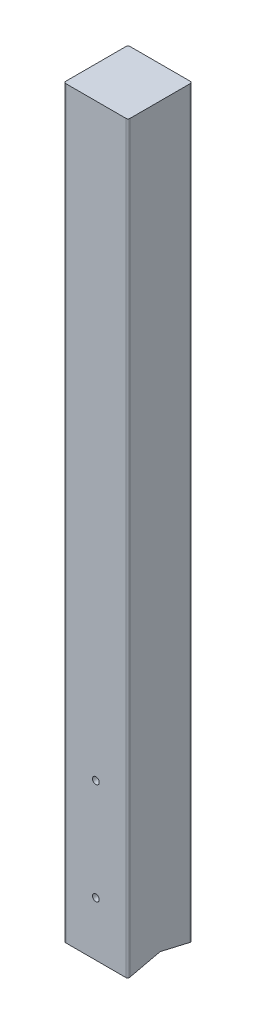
from build123d import *

# Parameters (mm, degrees)
SKETCH3_W                      = 95
SKETCH3_H                      = 95
EXTRUDE_L_NGD_DEPTH            = 1100
CUT_SKRUVH_L_REACH             = 1104.049
SKETCH5_R                      = 5
CUT_SKRUVH_L_DIRECTION_2_REACH = 1104.049
CUT_LUTANDE_BOTTEN_DEPTH       = 1103.049227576
CUT_LUTANDE_BOTTEN_DEPTH_BACK  = 1103.049227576
SKETCH7_R                      = 32.5
CUT_URTAG_R_RFOT_DEPTH         = 290
FILLET_KANTER_R                = 3


with BuildPart() as part:
    # Sketch3 → Extrude l_ngd (new body)
    with BuildSketch(Plane(origin=(0, 0, 0), x_dir=(1, 0, 0), z_dir=(0, 1, 0))):
        Rectangle(SKETCH3_W, SKETCH3_H)
    extrude(amount=EXTRUDE_L_NGD_DEPTH)

    # Sketch5 → Cut skruvh_l (cut, up to next)
    with BuildSketch(Plane.XY, mode=Mode.PRIVATE) as cut_skruvh_l_sk1:
        with Locations(Location((0, 80, 0), (0, 0, 180))):
            Circle(SKETCH5_R)
    cut_skruvh_l_tool1 = extrude(cut_skruvh_l_sk1.sketch, amount=-CUT_SKRUVH_L_REACH, mode=Mode.PRIVATE) & part.part
    # Sketch5 → Cut skruvh_l (cut, up to next)
    with BuildSketch(Plane.XY, mode=Mode.PRIVATE) as cut_skruvh_l_sk2:
        with Locations(Location((0, 230, 0), (0, 0, 180))):
            Circle(SKETCH5_R)
    cut_skruvh_l_tool2 = extrude(cut_skruvh_l_sk2.sketch, amount=-CUT_SKRUVH_L_REACH, mode=Mode.PRIVATE) & part.part
    add(cut_skruvh_l_tool1.solids().sort_by_distance((0, 80, 0))[0], mode=Mode.SUBTRACT)
    add(cut_skruvh_l_tool2.solids().sort_by_distance((0, 230, 0))[0], mode=Mode.SUBTRACT)

    # Sketch5 → Cut skruvh_l direction 2 (cut, up to next)
    with BuildSketch(Plane.XY, mode=Mode.PRIVATE) as cut_skruvh_l_direction_2_sk1:
        with Locations(Location((0, 80, 0), (0, 0, 180))):
            Circle(SKETCH5_R)
    cut_skruvh_l_direction_2_tool1 = extrude(cut_skruvh_l_direction_2_sk1.sketch, amount=CUT_SKRUVH_L_DIRECTION_2_REACH, mode=Mode.PRIVATE) & part.part
    # Sketch5 → Cut skruvh_l direction 2 (cut, up to next)
    with BuildSketch(Plane.XY, mode=Mode.PRIVATE) as cut_skruvh_l_direction_2_sk2:
        with Locations(Location((0, 230, 0), (0, 0, 180))):
            Circle(SKETCH5_R)
    cut_skruvh_l_direction_2_tool2 = extrude(cut_skruvh_l_direction_2_sk2.sketch, amount=CUT_SKRUVH_L_DIRECTION_2_REACH, mode=Mode.PRIVATE) & part.part
    add(cut_skruvh_l_direction_2_tool1.solids().sort_by_distance((0, 80, 0))[0], mode=Mode.SUBTRACT)
    add(cut_skruvh_l_direction_2_tool2.solids().sort_by_distance((0, 230, 0))[0], mode=Mode.SUBTRACT)

    # Sketch6 → Cut lutande botten (cut, two sides: drawn at the far end of the back side and taken through both)
    with BuildSketch(Plane(origin=(0, 0, 0), x_dir=(0, 0, -1), z_dir=(1, 0, 0)).offset(-CUT_LUTANDE_BOTTEN_DEPTH_BACK)):
        Polygon((2208.500106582, -500.442129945), (47.5, 0), (0, 11), (-47.5, 0), (-2208.500106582, -500.442129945), (-2208.500106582, -4936.820736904), (2208.500106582, -4936.820736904), align=None)
    extrude(amount=CUT_LUTANDE_BOTTEN_DEPTH + CUT_LUTANDE_BOTTEN_DEPTH_BACK, mode=Mode.SUBTRACT)

    # Sketch7 → Cut urtag r_rfot (cut)
    with BuildSketch(Plane(origin=(0, 0, 0), x_dir=(1, 0, 0), z_dir=(0, 1, 0))):
        Circle(SKETCH7_R)
    extrude(amount=CUT_URTAG_R_RFOT_DEPTH, mode=Mode.SUBTRACT)

    # Fillet kanter
    fillet_kanter_edges = [part.edges().sort_by_distance(p)[0] for p in [
        (47.5, 550, -47.5),
        (47.5, 550, 47.5),
        (-47.5, 550, 47.5),
        (-47.5, 550, -47.5),
    ]]
    fillet(fillet_kanter_edges, radius=FILLET_KANTER_R)


solid = part.part
